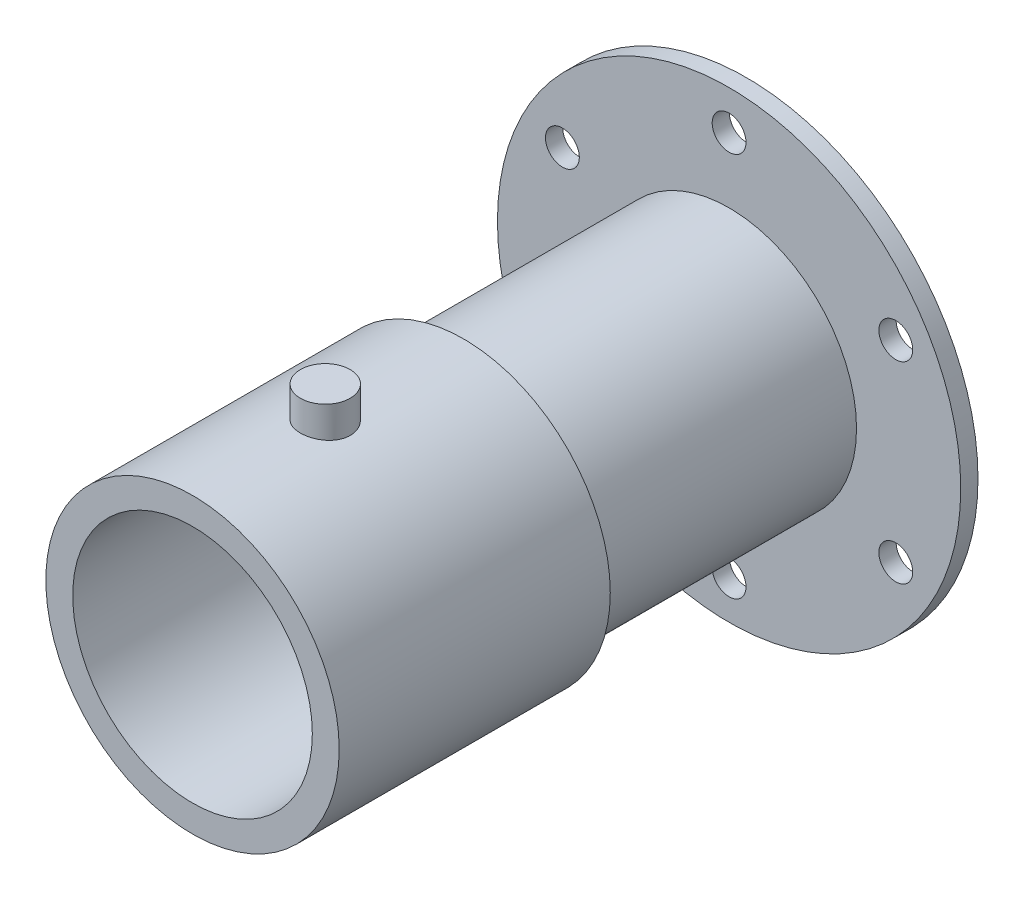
ISO-10303-21;
HEADER;
FILE_DESCRIPTION(('STEP AP214'),'2;1');
FILE_NAME('part.step','',(''),(''),'','','');
FILE_SCHEMA(('AUTOMOTIVE_DESIGN { 1 0 10303 214 1 1 1 1 }'));
ENDSEC;
DATA;
#1=APPLICATION_CONTEXT('core data for automotive mechanical design processes');
#2=APPLICATION_PROTOCOL_DEFINITION('international standard','automotive_design',2000,#1);
#3=PRODUCT_CONTEXT('',#1,'mechanical');
#4=PRODUCT('Part','Part','',(#3));
#5=PRODUCT_RELATED_PRODUCT_CATEGORY('part','',(#4));
#6=PRODUCT_DEFINITION_FORMATION('','',#4);
#7=PRODUCT_DEFINITION_CONTEXT('part definition',#1,'design');
#8=PRODUCT_DEFINITION('design','',#6,#7);
#9=PRODUCT_DEFINITION_SHAPE('','',#8);
#10=(LENGTH_UNIT() NAMED_UNIT(*) SI_UNIT(.MILLI.,.METRE.));
#11=(NAMED_UNIT(*) PLANE_ANGLE_UNIT() SI_UNIT($,.RADIAN.));
#12=(NAMED_UNIT(*) SI_UNIT($,.STERADIAN.) SOLID_ANGLE_UNIT());
#13=UNCERTAINTY_MEASURE_WITH_UNIT(LENGTH_MEASURE(1.E-05),#10,'distance_accuracy_value','');
#14=(GEOMETRIC_REPRESENTATION_CONTEXT(3) GLOBAL_UNCERTAINTY_ASSIGNED_CONTEXT((#13)) GLOBAL_UNIT_ASSIGNED_CONTEXT((#10,
#11,#12)) REPRESENTATION_CONTEXT('',''));
#15=CARTESIAN_POINT('',(0.,0.,0.));
#16=DIRECTION('',(0.,0.,1.));
#17=DIRECTION('',(1.,0.,0.));
#18=AXIS2_PLACEMENT_3D('',#15,#16,#17);
#19=CARTESIAN_POINT('',(0.,0.,3.302));
#20=DIRECTION('',(0.,0.,1.));
#21=DIRECTION('',(1.,0.,0.));
#22=AXIS2_PLACEMENT_3D('',#19,#20,#21);
#23=PLANE('',#22);
#24=CARTESIAN_POINT('',(-31.8957156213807,18.4150000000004,3.302));
#25=DIRECTION('',(0.,0.,1.));
#26=DIRECTION('',(0.50000000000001,0.866025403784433,0.));
#27=AXIS2_PLACEMENT_3D('',#24,#25,#26);
#28=CIRCLE('',#27,3.2385);
#29=CARTESIAN_POINT('',(-28.6572156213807,18.4150000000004,3.302));
#30=VERTEX_POINT('',#29);
#31=EDGE_CURVE('E89',#30,#30,#28,.T.);
#32=ORIENTED_EDGE('',*,*,#31,.F.);
#33=EDGE_LOOP('',(#32));
#34=FACE_BOUND('',#33,.T.);
#35=CARTESIAN_POINT('',(-31.895715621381,-18.4149999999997,3.302));
#36=DIRECTION('',(0.,0.,1.));
#37=DIRECTION('',(-0.499999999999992,0.866025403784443,0.));
#38=AXIS2_PLACEMENT_3D('',#35,#36,#37);
#39=CIRCLE('',#38,3.2385);
#40=CARTESIAN_POINT('',(-28.657215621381,-18.4149999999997,3.302));
#41=VERTEX_POINT('',#40);
#42=EDGE_CURVE('E83',#41,#41,#39,.T.);
#43=ORIENTED_EDGE('',*,*,#42,.F.);
#44=EDGE_LOOP('',(#43));
#45=FACE_BOUND('',#44,.T.);
#46=CARTESIAN_POINT('',(-2.57182664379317E-13,-36.83,3.302));
#47=DIRECTION('',(0.,0.,1.));
#48=DIRECTION('',(-1.,0.,0.));
#49=AXIS2_PLACEMENT_3D('',#46,#47,#48);
#50=CIRCLE('',#49,3.2385);
#51=CARTESIAN_POINT('',(3.23849999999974,-36.83,3.302));
#52=VERTEX_POINT('',#51);
#53=EDGE_CURVE('E77',#52,#52,#50,.T.);
#54=ORIENTED_EDGE('',*,*,#53,.F.);
#55=EDGE_LOOP('',(#54));
#56=FACE_BOUND('',#55,.T.);
#57=CARTESIAN_POINT('',(31.8957156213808,-18.4150000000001,3.302));
#58=DIRECTION('',(0.,0.,1.));
#59=DIRECTION('',(-0.500000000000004,-0.866025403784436,0.));
#60=AXIS2_PLACEMENT_3D('',#57,#58,#59);
#61=CIRCLE('',#60,3.2385);
#62=CARTESIAN_POINT('',(35.1342156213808,-18.4150000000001,3.302));
#63=VERTEX_POINT('',#62);
#64=EDGE_CURVE('E71',#63,#63,#61,.T.);
#65=ORIENTED_EDGE('',*,*,#64,.F.);
#66=EDGE_LOOP('',(#65));
#67=FACE_BOUND('',#66,.T.);
#68=CARTESIAN_POINT('',(31.8957156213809,18.4149999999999,3.302));
#69=DIRECTION('',(0.,0.,1.));
#70=DIRECTION('',(0.499999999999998,-0.86602540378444,0.));
#71=AXIS2_PLACEMENT_3D('',#68,#69,#70);
#72=CIRCLE('',#71,3.2385);
#73=CARTESIAN_POINT('',(35.1342156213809,18.4149999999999,3.302));
#74=VERTEX_POINT('',#73);
#75=EDGE_CURVE('E65',#74,#74,#72,.T.);
#76=ORIENTED_EDGE('',*,*,#75,.F.);
#77=EDGE_LOOP('',(#76));
#78=FACE_BOUND('',#77,.T.);
#79=CARTESIAN_POINT('',(0.,36.83,3.302));
#80=DIRECTION('',(0.,0.,1.));
#81=DIRECTION('',(1.,0.,0.));
#82=AXIS2_PLACEMENT_3D('',#79,#80,#81);
#83=CIRCLE('',#82,3.2385);
#84=CARTESIAN_POINT('',(3.2385,36.83,3.302));
#85=VERTEX_POINT('',#84);
#86=EDGE_CURVE('E59',#85,#85,#83,.T.);
#87=ORIENTED_EDGE('',*,*,#86,.F.);
#88=EDGE_LOOP('',(#87));
#89=FACE_BOUND('',#88,.T.);
#90=CARTESIAN_POINT('',(0.,0.,3.302));
#91=DIRECTION('',(0.,0.,1.));
#92=DIRECTION('',(1.,0.,0.));
#93=AXIS2_PLACEMENT_3D('',#90,#91,#92);
#94=CIRCLE('',#93,44.323);
#95=CARTESIAN_POINT('',(-44.323,0.,3.302));
#96=VERTEX_POINT('',#95);
#97=EDGE_CURVE('E10',#96,#96,#94,.T.);
#98=ORIENTED_EDGE('',*,*,#97,.T.);
#99=EDGE_LOOP('',(#98));
#100=FACE_BOUND('',#99,.T.);
#101=CARTESIAN_POINT('',(0.,0.,3.302));
#102=DIRECTION('',(0.,0.,1.));
#103=DIRECTION('',(1.,0.,0.));
#104=AXIS2_PLACEMENT_3D('',#101,#102,#103);
#105=CIRCLE('',#104,24.384);
#106=CARTESIAN_POINT('',(24.384,0.,3.302));
#107=VERTEX_POINT('',#106);
#108=EDGE_CURVE('E39',#107,#107,#105,.T.);
#109=ORIENTED_EDGE('',*,*,#108,.F.);
#110=EDGE_LOOP('',(#109));
#111=FACE_BOUND('',#110,.T.);
#112=ADVANCED_FACE('F24',(#34,#45,#56,#67,#78,#89,#100,#111),#23,.T.);
#113=CARTESIAN_POINT('',(0.,0.,3.302));
#114=DIRECTION('',(0.,0.,-1.));
#115=DIRECTION('',(-1.,0.,0.));
#116=AXIS2_PLACEMENT_3D('',#113,#114,#115);
#117=CYLINDRICAL_SURFACE('',#116,44.323);
#118=CARTESIAN_POINT('',(0.,0.,0.));
#119=DIRECTION('',(0.,0.,1.));
#120=DIRECTION('',(1.,0.,0.));
#121=AXIS2_PLACEMENT_3D('',#118,#119,#120);
#122=CIRCLE('',#121,44.323);
#123=CARTESIAN_POINT('',(-44.323,0.,0.));
#124=VERTEX_POINT('',#123);
#125=EDGE_CURVE('E31',#124,#124,#122,.T.);
#126=CARTESIAN_POINT('',(-44.323,0.,3.302));
#127=CARTESIAN_POINT('',(-44.323,0.,3.26760416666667));
#128=CARTESIAN_POINT('',(-44.323,0.,3.23320833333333));
#129=CARTESIAN_POINT('',(-44.323,0.,3.16441666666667));
#130=CARTESIAN_POINT('',(-44.323,0.,3.13002083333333));
#131=CARTESIAN_POINT('',(-44.323,0.,3.06122916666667));
#132=CARTESIAN_POINT('',(-44.323,0.,3.02683333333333));
#133=CARTESIAN_POINT('',(-44.323,0.,2.95804166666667));
#134=CARTESIAN_POINT('',(-44.323,0.,2.92364583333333));
#135=CARTESIAN_POINT('',(-44.323,0.,2.85485416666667));
#136=CARTESIAN_POINT('',(-44.323,0.,2.82045833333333));
#137=CARTESIAN_POINT('',(-44.323,0.,2.75166666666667));
#138=CARTESIAN_POINT('',(-44.323,0.,2.71727083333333));
#139=CARTESIAN_POINT('',(-44.323,0.,2.64847916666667));
#140=CARTESIAN_POINT('',(-44.323,0.,2.61408333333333));
#141=CARTESIAN_POINT('',(-44.323,0.,2.54529166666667));
#142=CARTESIAN_POINT('',(-44.323,0.,2.51089583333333));
#143=CARTESIAN_POINT('',(-44.323,0.,2.44210416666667));
#144=CARTESIAN_POINT('',(-44.323,0.,2.40770833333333));
#145=CARTESIAN_POINT('',(-44.323,0.,2.33891666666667));
#146=CARTESIAN_POINT('',(-44.323,0.,2.30452083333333));
#147=CARTESIAN_POINT('',(-44.323,0.,2.23572916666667));
#148=CARTESIAN_POINT('',(-44.323,0.,2.20133333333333));
#149=CARTESIAN_POINT('',(-44.323,0.,2.13254166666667));
#150=CARTESIAN_POINT('',(-44.323,0.,2.09814583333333));
#151=CARTESIAN_POINT('',(-44.323,0.,2.02935416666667));
#152=CARTESIAN_POINT('',(-44.323,0.,1.99495833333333));
#153=CARTESIAN_POINT('',(-44.323,0.,1.92616666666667));
#154=CARTESIAN_POINT('',(-44.323,0.,1.89177083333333));
#155=CARTESIAN_POINT('',(-44.323,0.,1.82297916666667));
#156=CARTESIAN_POINT('',(-44.323,0.,1.78858333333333));
#157=CARTESIAN_POINT('',(-44.323,0.,1.71979166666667));
#158=CARTESIAN_POINT('',(-44.323,0.,1.68539583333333));
#159=CARTESIAN_POINT('',(-44.323,0.,1.61660416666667));
#160=CARTESIAN_POINT('',(-44.323,0.,1.58220833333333));
#161=CARTESIAN_POINT('',(-44.323,0.,1.51341666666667));
#162=CARTESIAN_POINT('',(-44.323,0.,1.47902083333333));
#163=CARTESIAN_POINT('',(-44.323,0.,1.41022916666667));
#164=CARTESIAN_POINT('',(-44.323,0.,1.37583333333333));
#165=CARTESIAN_POINT('',(-44.323,0.,1.30704166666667));
#166=CARTESIAN_POINT('',(-44.323,0.,1.27264583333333));
#167=CARTESIAN_POINT('',(-44.323,0.,1.20385416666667));
#168=CARTESIAN_POINT('',(-44.323,0.,1.16945833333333));
#169=CARTESIAN_POINT('',(-44.323,0.,1.10066666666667));
#170=CARTESIAN_POINT('',(-44.323,0.,1.06627083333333));
#171=CARTESIAN_POINT('',(-44.323,0.,0.997479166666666));
#172=CARTESIAN_POINT('',(-44.323,0.,0.963083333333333));
#173=CARTESIAN_POINT('',(-44.323,0.,0.894291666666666));
#174=CARTESIAN_POINT('',(-44.323,0.,0.859895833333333));
#175=CARTESIAN_POINT('',(-44.323,0.,0.791104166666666));
#176=CARTESIAN_POINT('',(-44.323,0.,0.756708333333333));
#177=CARTESIAN_POINT('',(-44.323,0.,0.687916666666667));
#178=CARTESIAN_POINT('',(-44.323,0.,0.653520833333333));
#179=CARTESIAN_POINT('',(-44.323,0.,0.584729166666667));
#180=CARTESIAN_POINT('',(-44.323,0.,0.550333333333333));
#181=CARTESIAN_POINT('',(-44.323,0.,0.481541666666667));
#182=CARTESIAN_POINT('',(-44.323,0.,0.447145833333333));
#183=CARTESIAN_POINT('',(-44.323,0.,0.378354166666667));
#184=CARTESIAN_POINT('',(-44.323,0.,0.343958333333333));
#185=CARTESIAN_POINT('',(-44.323,0.,0.275166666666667));
#186=CARTESIAN_POINT('',(-44.323,0.,0.240770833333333));
#187=CARTESIAN_POINT('',(-44.323,0.,0.171979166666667));
#188=CARTESIAN_POINT('',(-44.323,0.,0.137583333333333));
#189=CARTESIAN_POINT('',(-44.323,0.,0.0687916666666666));
#190=CARTESIAN_POINT('',(-44.323,0.,0.0343958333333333));
#191=CARTESIAN_POINT('',(-44.323,0.,0.));
#192=B_SPLINE_CURVE_WITH_KNOTS('',3,(#126,#127,#128,#129,#130,#131,#132,#133,#134,#135,#136,
#137,#138,#139,#140,#141,#142,#143,#144,#145,#146,#147,#148,#149,#150,#151,#152,#153,#154,#155,
#156,#157,#158,#159,#160,#161,#162,#163,#164,#165,#166,#167,#168,#169,#170,#171,#172,#173,#174,
#175,#176,#177,#178,#179,#180,#181,#182,#183,#184,#185,#186,#187,#188,#189,#190,#191),
.UNSPECIFIED.,.F.,.F.,(4,2,2,2,2,2,2,2,2,2,2,2,2,2,2,2,2,2,2,2,2,2,2,2,2,2,2,2,2,2,2,2,4),(0.,
0.1031875,0.206375,0.3095625,0.41275,0.5159375,0.619125,0.7223125,0.8255,0.9286875,1.031875,
1.1350625,1.23825,1.3414375,1.444625,1.5478125,1.651,1.7541875,1.857375,1.9605625,2.06375,
2.1669375,2.270125,2.3733125,2.4765,2.5796875,2.682875,2.7860625,2.88925,2.9924375,3.095625,
3.1988125,3.302),.UNSPECIFIED.);
#193=EDGE_CURVE('BSEAM26',#96,#124,#192,.T.);
#194=ORIENTED_EDGE('',*,*,#97,.F.);
#195=ORIENTED_EDGE('',*,*,#125,.T.);
#196=ORIENTED_EDGE('',*,*,#193,.T.);
#197=ORIENTED_EDGE('',*,*,#193,.F.);
#198=EDGE_LOOP('',(#194,#196,#195,#197));
#199=FACE_BOUND('',#198,.T.);
#200=ADVANCED_FACE('F26',(#199),#117,.T.);
#201=CARTESIAN_POINT('',(0.,0.,0.));
#202=DIRECTION('',(0.,0.,1.));
#203=DIRECTION('',(1.,0.,0.));
#204=AXIS2_PLACEMENT_3D('',#201,#202,#203);
#205=PLANE('',#204);
#206=CARTESIAN_POINT('',(-31.8957156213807,18.4150000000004,0.));
#207=DIRECTION('',(0.,0.,1.));
#208=DIRECTION('',(0.50000000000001,0.866025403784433,0.));
#209=AXIS2_PLACEMENT_3D('',#206,#207,#208);
#210=CIRCLE('',#209,3.2385);
#211=CARTESIAN_POINT('',(-28.6572156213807,18.4150000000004,0.));
#212=VERTEX_POINT('',#211);
#213=EDGE_CURVE('E86',#212,#212,#210,.T.);
#214=ORIENTED_EDGE('',*,*,#213,.T.);
#215=EDGE_LOOP('',(#214));
#216=FACE_BOUND('',#215,.T.);
#217=CARTESIAN_POINT('',(-31.895715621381,-18.4149999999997,0.));
#218=DIRECTION('',(0.,0.,1.));
#219=DIRECTION('',(-0.499999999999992,0.866025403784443,0.));
#220=AXIS2_PLACEMENT_3D('',#217,#218,#219);
#221=CIRCLE('',#220,3.2385);
#222=CARTESIAN_POINT('',(-28.657215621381,-18.4149999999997,0.));
#223=VERTEX_POINT('',#222);
#224=EDGE_CURVE('E80',#223,#223,#221,.T.);
#225=ORIENTED_EDGE('',*,*,#224,.T.);
#226=EDGE_LOOP('',(#225));
#227=FACE_BOUND('',#226,.T.);
#228=CARTESIAN_POINT('',(-2.57182664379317E-13,-36.83,0.));
#229=DIRECTION('',(0.,0.,1.));
#230=DIRECTION('',(-1.,0.,0.));
#231=AXIS2_PLACEMENT_3D('',#228,#229,#230);
#232=CIRCLE('',#231,3.2385);
#233=CARTESIAN_POINT('',(3.23849999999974,-36.83,0.));
#234=VERTEX_POINT('',#233);
#235=EDGE_CURVE('E74',#234,#234,#232,.T.);
#236=ORIENTED_EDGE('',*,*,#235,.T.);
#237=EDGE_LOOP('',(#236));
#238=FACE_BOUND('',#237,.T.);
#239=CARTESIAN_POINT('',(31.8957156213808,-18.4150000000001,0.));
#240=DIRECTION('',(0.,0.,1.));
#241=DIRECTION('',(-0.500000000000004,-0.866025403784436,0.));
#242=AXIS2_PLACEMENT_3D('',#239,#240,#241);
#243=CIRCLE('',#242,3.2385);
#244=CARTESIAN_POINT('',(35.1342156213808,-18.4150000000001,0.));
#245=VERTEX_POINT('',#244);
#246=EDGE_CURVE('E68',#245,#245,#243,.T.);
#247=ORIENTED_EDGE('',*,*,#246,.T.);
#248=EDGE_LOOP('',(#247));
#249=FACE_BOUND('',#248,.T.);
#250=CARTESIAN_POINT('',(31.8957156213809,18.4149999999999,0.));
#251=DIRECTION('',(0.,0.,1.));
#252=DIRECTION('',(0.499999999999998,-0.86602540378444,0.));
#253=AXIS2_PLACEMENT_3D('',#250,#251,#252);
#254=CIRCLE('',#253,3.2385);
#255=CARTESIAN_POINT('',(35.1342156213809,18.4149999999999,0.));
#256=VERTEX_POINT('',#255);
#257=EDGE_CURVE('E62',#256,#256,#254,.T.);
#258=ORIENTED_EDGE('',*,*,#257,.T.);
#259=EDGE_LOOP('',(#258));
#260=FACE_BOUND('',#259,.T.);
#261=CARTESIAN_POINT('',(0.,36.83,0.));
#262=DIRECTION('',(0.,0.,1.));
#263=DIRECTION('',(1.,0.,0.));
#264=AXIS2_PLACEMENT_3D('',#261,#262,#263);
#265=CIRCLE('',#264,3.2385);
#266=CARTESIAN_POINT('',(3.2385,36.83,0.));
#267=VERTEX_POINT('',#266);
#268=EDGE_CURVE('E56',#267,#267,#265,.T.);
#269=ORIENTED_EDGE('',*,*,#268,.T.);
#270=EDGE_LOOP('',(#269));
#271=FACE_BOUND('',#270,.T.);
#272=ORIENTED_EDGE('',*,*,#125,.F.);
#273=EDGE_LOOP('',(#272));
#274=FACE_BOUND('',#273,.T.);
#275=ADVANCED_FACE('F121',(#216,#227,#238,#249,#260,#271,#274),#205,.F.);
#276=CARTESIAN_POINT('',(0.,0.,54.102));
#277=DIRECTION('',(0.,0.,-1.));
#278=DIRECTION('',(-1.,0.,0.));
#279=AXIS2_PLACEMENT_3D('',#276,#277,#278);
#280=CYLINDRICAL_SURFACE('',#279,24.384);
#281=CARTESIAN_POINT('',(0.,0.,54.102));
#282=DIRECTION('',(0.,0.,1.));
#283=DIRECTION('',(1.,0.,0.));
#284=AXIS2_PLACEMENT_3D('',#281,#282,#283);
#285=CIRCLE('',#284,24.384);
#286=CARTESIAN_POINT('',(24.384,0.,54.102));
#287=VERTEX_POINT('',#286);
#288=EDGE_CURVE('E35',#287,#287,#285,.T.);
#289=ORIENTED_EDGE('',*,*,#288,.F.);
#290=EDGE_LOOP('',(#289));
#291=FACE_BOUND('',#290,.T.);
#292=ORIENTED_EDGE('',*,*,#108,.T.);
#293=EDGE_LOOP('',(#292));
#294=FACE_BOUND('',#293,.T.);
#295=ADVANCED_FACE('F127',(#291,#294),#280,.T.);
#296=CARTESIAN_POINT('',(0.,0.,54.102));
#297=DIRECTION('',(0.,0.,1.));
#298=DIRECTION('',(1.,0.,0.));
#299=AXIS2_PLACEMENT_3D('',#296,#297,#298);
#300=PLANE('',#299);
#301=CARTESIAN_POINT('',(0.,0.,54.102));
#302=DIRECTION('',(0.,0.,1.));
#303=DIRECTION('',(1.,0.,0.));
#304=AXIS2_PLACEMENT_3D('',#301,#302,#303);
#305=CIRCLE('',#304,28.067);
#306=CARTESIAN_POINT('',(28.067,0.,54.102));
#307=VERTEX_POINT('',#306);
#308=EDGE_CURVE('E47',#307,#307,#305,.T.);
#309=ORIENTED_EDGE('',*,*,#308,.F.);
#310=EDGE_LOOP('',(#309));
#311=FACE_BOUND('',#310,.T.);
#312=ORIENTED_EDGE('',*,*,#288,.T.);
#313=EDGE_LOOP('',(#312));
#314=FACE_BOUND('',#313,.T.);
#315=ADVANCED_FACE('F131',(#311,#314),#300,.F.);
#316=CARTESIAN_POINT('',(0.,0.,105.9688));
#317=DIRECTION('',(0.,0.,-1.));
#318=DIRECTION('',(-1.,0.,0.));
#319=AXIS2_PLACEMENT_3D('',#316,#317,#318);
#320=CYLINDRICAL_SURFACE('',#319,28.067);
#321=CARTESIAN_POINT('',(0.,28.067,85.3313));
#322=CARTESIAN_POINT('',(0.265468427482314,28.0669954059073,85.3312894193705));
#323=CARTESIAN_POINT('',(0.531079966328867,28.0631944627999,85.3090286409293));
#324=CARTESIAN_POINT('',(1.05484861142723,28.0483978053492,85.2206135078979));
#325=CARTESIAN_POINT('',(1.31299871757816,28.0373955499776,85.1544192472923));
#326=CARTESIAN_POINT('',(1.81419127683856,28.0094298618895,84.980197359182));
#327=CARTESIAN_POINT('',(2.05724607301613,27.9924713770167,84.8722044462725));
#328=CARTESIAN_POINT('',(2.52175623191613,27.9544560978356,84.6175427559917));
#329=CARTESIAN_POINT('',(2.74321396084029,27.9333997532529,84.4708782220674));
#330=CARTESIAN_POINT('',(3.16046456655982,27.8892886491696,84.1414933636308));
#331=CARTESIAN_POINT('',(3.35601276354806,27.866217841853,83.9584652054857));
#332=CARTESIAN_POINT('',(3.7137794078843,27.8208003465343,83.5622111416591));
#333=CARTESIAN_POINT('',(3.87599571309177,27.7984537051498,83.3489832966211));
#334=CARTESIAN_POINT('',(4.16347957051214,27.7568592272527,82.8966951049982));
#335=CARTESIAN_POINT('',(4.28850420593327,27.7376321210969,82.6574782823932));
#336=CARTESIAN_POINT('',(4.49650209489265,27.7046768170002,82.1610576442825));
#337=CARTESIAN_POINT('',(4.57947829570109,27.6909482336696,81.9038550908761));
#338=CARTESIAN_POINT('',(4.70025101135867,27.6707043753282,81.3813611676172));
#339=CARTESIAN_POINT('',(4.73847055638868,27.664121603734,81.1161702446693));
#340=CARTESIAN_POINT('',(4.76995685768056,27.6587106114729,80.5830640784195));
#341=CARTESIAN_POINT('',(4.76322691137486,27.6598818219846,80.3151490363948));
#342=CARTESIAN_POINT('',(4.70534962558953,27.6697848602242,79.7872257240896));
#343=CARTESIAN_POINT('',(4.65467829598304,27.6784356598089,79.5271635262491));
#344=CARTESIAN_POINT('',(4.51110400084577,27.7021962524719,79.0192861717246));
#345=CARTESIAN_POINT('',(4.4181995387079,27.7173062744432,78.771471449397));
#346=CARTESIAN_POINT('',(4.19231595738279,27.7523699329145,78.2937030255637));
#347=CARTESIAN_POINT('',(4.05913992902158,27.7723472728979,78.0638442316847));
#348=CARTESIAN_POINT('',(3.75663332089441,27.8148782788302,77.6295557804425));
#349=CARTESIAN_POINT('',(3.58729971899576,27.8374321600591,77.4251282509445));
#350=CARTESIAN_POINT('',(3.21469491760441,27.8829306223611,77.0447505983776));
#351=CARTESIAN_POINT('',(3.01101547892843,27.9058764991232,76.8692002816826));
#352=CARTESIAN_POINT('',(2.57687937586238,27.9493057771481,76.5547069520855));
#353=CARTESIAN_POINT('',(2.34642252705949,27.9697891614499,76.4157641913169));
#354=CARTESIAN_POINT('',(1.86489184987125,28.0060162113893,76.1783905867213));
#355=CARTESIAN_POINT('',(1.61379984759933,28.0217556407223,76.0799959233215));
#356=CARTESIAN_POINT('',(1.09832729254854,28.0466875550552,75.9268871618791));
#357=CARTESIAN_POINT('',(0.833947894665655,28.0558806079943,75.8721692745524));
#358=CARTESIAN_POINT('',(0.302850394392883,28.0666073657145,75.8085112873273));
#359=CARTESIAN_POINT('',(0.0361998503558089,28.0682328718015,75.7990224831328));
#360=CARTESIAN_POINT('',(-0.494880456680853,28.0638931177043,75.8246279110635));
#361=CARTESIAN_POINT('',(-0.759310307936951,28.0579281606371,75.8597203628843));
#362=CARTESIAN_POINT('',(-1.27674190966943,28.0391345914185,75.9730357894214));
#363=CARTESIAN_POINT('',(-1.52980504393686,28.0263493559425,76.0509862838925));
#364=CARTESIAN_POINT('',(-2.019271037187,27.9953430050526,76.2475139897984));
#365=CARTESIAN_POINT('',(-2.25567293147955,27.9771215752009,76.3660935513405));
#366=CARTESIAN_POINT('',(-2.7074835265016,27.9370361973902,76.6417642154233));
#367=CARTESIAN_POINT('',(-2.9226808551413,27.9151405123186,76.7991970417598));
#368=CARTESIAN_POINT('',(-3.3237981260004,27.8702290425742,77.1476362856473));
#369=CARTESIAN_POINT('',(-3.50971585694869,27.847213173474,77.3386452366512));
#370=CARTESIAN_POINT('',(-3.84903742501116,27.8023574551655,77.751278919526));
#371=CARTESIAN_POINT('',(-4.00207000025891,27.7805329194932,77.9732108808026));
#372=CARTESIAN_POINT('',(-4.26868195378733,27.7408198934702,78.4399540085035));
#373=CARTESIAN_POINT('',(-4.38226261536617,27.7229312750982,78.6847644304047));
#374=CARTESIAN_POINT('',(-4.56619528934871,27.6932311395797,79.1892903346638));
#375=CARTESIAN_POINT('',(-4.63673007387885,27.6813939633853,79.4489376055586));
#376=CARTESIAN_POINT('',(-4.73314247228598,27.6650733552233,79.9766129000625));
#377=CARTESIAN_POINT('',(-4.75902412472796,27.6605892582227,80.244640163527));
#378=CARTESIAN_POINT('',(-4.7652798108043,27.6595118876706,80.7777583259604));
#379=CARTESIAN_POINT('',(-4.74623838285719,27.6628172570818,81.0428423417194));
#380=CARTESIAN_POINT('',(-4.66445456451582,27.6767238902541,81.5659759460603));
#381=CARTESIAN_POINT('',(-4.6017123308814,27.6873251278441,81.8240255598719));
#382=CARTESIAN_POINT('',(-4.4345350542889,27.7145899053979,82.3255270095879));
#383=CARTESIAN_POINT('',(-4.33015213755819,27.7312458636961,82.5689966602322));
#384=CARTESIAN_POINT('',(-4.08271707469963,27.7687504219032,83.035062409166));
#385=CARTESIAN_POINT('',(-3.93966289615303,27.7895992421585,83.2576574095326));
#386=CARTESIAN_POINT('',(-3.61686733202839,27.8334608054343,83.6786050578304));
#387=CARTESIAN_POINT('',(-3.43669652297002,27.8564970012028,83.8766260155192));
#388=CARTESIAN_POINT('',(-3.04568638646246,27.9019522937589,84.2398232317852));
#389=CARTESIAN_POINT('',(-2.83483999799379,27.9243712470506,84.4049919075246));
#390=CARTESIAN_POINT('',(-2.386660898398,27.9662530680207,84.6988843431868));
#391=CARTESIAN_POINT('',(-2.14914876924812,27.9856935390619,84.8273377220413));
#392=CARTESIAN_POINT('',(-1.65568130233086,28.0192100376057,85.0423235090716));
#393=CARTESIAN_POINT('',(-1.39974447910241,28.0332913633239,85.1288973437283));
#394=CARTESIAN_POINT('',(-0.952370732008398,28.051457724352,85.2390413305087));
#395=CARTESIAN_POINT('',(-0.763628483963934,28.0572546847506,85.2735824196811));
#396=CARTESIAN_POINT('',(-0.383282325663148,28.065027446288,85.3197153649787));
#397=CARTESIAN_POINT('',(-0.191678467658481,28.0670033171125,85.3313076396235));
#398=CARTESIAN_POINT('',(0.,28.067,85.3313));
#399=B_SPLINE_CURVE_WITH_KNOTS('',3,(#321,#322,#323,#324,#325,#326,#327,#328,#329,#330,#331,
#332,#333,#334,#335,#336,#337,#338,#339,#340,#341,#342,#343,#344,#345,#346,#347,#348,#349,#350,
#351,#352,#353,#354,#355,#356,#357,#358,#359,#360,#361,#362,#363,#364,#365,#366,#367,#368,#369,
#370,#371,#372,#373,#374,#375,#376,#377,#378,#379,#380,#381,#382,#383,#384,#385,#386,#387,#388,
#389,#390,#391,#392,#393,#394,#395,#396,#397,#398),.UNSPECIFIED.,.T.,.F.,(4,2,2,2,2,2,2,2,2,2,2,
2,2,2,2,2,2,2,2,2,2,2,2,2,2,2,2,2,2,2,2,2,2,2,2,2,2,2,4),(0.,0.795704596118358,1.59213294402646,
2.38790125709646,3.18358228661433,3.98631049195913,4.78909027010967,5.59700373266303,
6.40486055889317,7.20501844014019,8.00511762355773,8.79665622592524,9.58822288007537,
10.3837242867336,11.1792922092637,11.9850859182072,12.790885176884,13.5974018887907,
14.4038486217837,15.2004864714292,15.9970925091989,16.7886915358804,17.5803363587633,
18.3792088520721,19.1781416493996,19.9856684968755,20.7931690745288,21.5972167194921,
22.4011916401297,23.194763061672,23.9883316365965,24.7809099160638,25.5735298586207,
26.3758945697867,27.1784442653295,27.9867602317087,28.794274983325,29.3688149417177,
29.9433444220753),.UNSPECIFIED.);
#400=CARTESIAN_POINT('',(0.,28.067,85.3313));
#401=VERTEX_POINT('',#400);
#402=EDGE_CURVE('E92',#401,#401,#399,.T.);
#403=ORIENTED_EDGE('',*,*,#402,.F.);
#404=EDGE_LOOP('',(#403));
#405=FACE_BOUND('',#404,.T.);
#406=CARTESIAN_POINT('',(0.,0.,105.9688));
#407=DIRECTION('',(0.,0.,1.));
#408=DIRECTION('',(1.,0.,0.));
#409=AXIS2_PLACEMENT_3D('',#406,#407,#408);
#410=CIRCLE('',#409,28.067);
#411=CARTESIAN_POINT('',(28.067,0.,105.9688));
#412=VERTEX_POINT('',#411);
#413=EDGE_CURVE('E44',#412,#412,#410,.T.);
#414=ORIENTED_EDGE('',*,*,#413,.F.);
#415=EDGE_LOOP('',(#414));
#416=FACE_BOUND('',#415,.T.);
#417=ORIENTED_EDGE('',*,*,#308,.T.);
#418=EDGE_LOOP('',(#417));
#419=FACE_BOUND('',#418,.T.);
#420=ADVANCED_FACE('F133',(#405,#416,#419),#320,.T.);
#421=CARTESIAN_POINT('',(0.,0.,105.9688));
#422=DIRECTION('',(0.,0.,1.));
#423=DIRECTION('',(1.,0.,0.));
#424=AXIS2_PLACEMENT_3D('',#421,#422,#423);
#425=PLANE('',#424);
#426=CARTESIAN_POINT('',(0.,0.,105.9688));
#427=DIRECTION('',(0.,0.,1.));
#428=DIRECTION('',(1.,0.,0.));
#429=AXIS2_PLACEMENT_3D('',#426,#427,#428);
#430=CIRCLE('',#429,22.9235);
#431=CARTESIAN_POINT('',(22.9235,0.,105.9688));
#432=VERTEX_POINT('',#431);
#433=EDGE_CURVE('E53',#432,#432,#430,.T.);
#434=ORIENTED_EDGE('',*,*,#433,.F.);
#435=EDGE_LOOP('',(#434));
#436=FACE_BOUND('',#435,.T.);
#437=ORIENTED_EDGE('',*,*,#413,.T.);
#438=EDGE_LOOP('',(#437));
#439=FACE_BOUND('',#438,.T.);
#440=ADVANCED_FACE('F136',(#436,#439),#425,.T.);
#441=CARTESIAN_POINT('',(0.,0.,61.5188));
#442=DIRECTION('',(0.,0.,1.));
#443=DIRECTION('',(1.,0.,0.));
#444=AXIS2_PLACEMENT_3D('',#441,#442,#443);
#445=CYLINDRICAL_SURFACE('',#444,22.9235);
#446=CARTESIAN_POINT('',(0.,0.,61.5188));
#447=DIRECTION('',(0.,0.,1.));
#448=DIRECTION('',(1.,0.,0.));
#449=AXIS2_PLACEMENT_3D('',#446,#447,#448);
#450=CIRCLE('',#449,22.9235);
#451=CARTESIAN_POINT('',(22.9235,0.,61.5188));
#452=VERTEX_POINT('',#451);
#453=EDGE_CURVE('E50',#452,#452,#450,.T.);
#454=ORIENTED_EDGE('',*,*,#453,.F.);
#455=EDGE_LOOP('',(#454));
#456=FACE_BOUND('',#455,.T.);
#457=ORIENTED_EDGE('',*,*,#433,.T.);
#458=EDGE_LOOP('',(#457));
#459=FACE_BOUND('',#458,.T.);
#460=ADVANCED_FACE('F140',(#456,#459),#445,.F.);
#461=CARTESIAN_POINT('',(0.,0.,61.5188));
#462=DIRECTION('',(0.,0.,1.));
#463=DIRECTION('',(1.,0.,0.));
#464=AXIS2_PLACEMENT_3D('',#461,#462,#463);
#465=PLANE('',#464);
#466=ORIENTED_EDGE('',*,*,#453,.T.);
#467=EDGE_LOOP('',(#466));
#468=FACE_BOUND('',#467,.T.);
#469=ADVANCED_FACE('F147',(#468),#465,.T.);
#470=CARTESIAN_POINT('',(0.,36.83,0.));
#471=DIRECTION('',(0.,0.,1.));
#472=DIRECTION('',(1.,0.,0.));
#473=AXIS2_PLACEMENT_3D('',#470,#471,#472);
#474=CYLINDRICAL_SURFACE('',#473,3.2385);
#475=CARTESIAN_POINT('',(3.2385,36.83,0.));
#476=CARTESIAN_POINT('',(3.2385,36.83,0.0343958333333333));
#477=CARTESIAN_POINT('',(3.2385,36.83,0.0687916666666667));
#478=CARTESIAN_POINT('',(3.2385,36.83,0.137583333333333));
#479=CARTESIAN_POINT('',(3.2385,36.83,0.171979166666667));
#480=CARTESIAN_POINT('',(3.2385,36.83,0.240770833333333));
#481=CARTESIAN_POINT('',(3.2385,36.83,0.275166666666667));
#482=CARTESIAN_POINT('',(3.2385,36.83,0.343958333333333));
#483=CARTESIAN_POINT('',(3.2385,36.83,0.378354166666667));
#484=CARTESIAN_POINT('',(3.2385,36.83,0.447145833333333));
#485=CARTESIAN_POINT('',(3.2385,36.83,0.481541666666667));
#486=CARTESIAN_POINT('',(3.2385,36.83,0.550333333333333));
#487=CARTESIAN_POINT('',(3.2385,36.83,0.584729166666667));
#488=CARTESIAN_POINT('',(3.2385,36.83,0.653520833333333));
#489=CARTESIAN_POINT('',(3.2385,36.83,0.687916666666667));
#490=CARTESIAN_POINT('',(3.2385,36.83,0.756708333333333));
#491=CARTESIAN_POINT('',(3.2385,36.83,0.791104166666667));
#492=CARTESIAN_POINT('',(3.2385,36.83,0.859895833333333));
#493=CARTESIAN_POINT('',(3.2385,36.83,0.894291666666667));
#494=CARTESIAN_POINT('',(3.2385,36.83,0.963083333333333));
#495=CARTESIAN_POINT('',(3.2385,36.83,0.997479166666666));
#496=CARTESIAN_POINT('',(3.2385,36.83,1.06627083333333));
#497=CARTESIAN_POINT('',(3.2385,36.83,1.10066666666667));
#498=CARTESIAN_POINT('',(3.2385,36.83,1.16945833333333));
#499=CARTESIAN_POINT('',(3.2385,36.83,1.20385416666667));
#500=CARTESIAN_POINT('',(3.2385,36.83,1.27264583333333));
#501=CARTESIAN_POINT('',(3.2385,36.83,1.30704166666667));
#502=CARTESIAN_POINT('',(3.2385,36.83,1.37583333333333));
#503=CARTESIAN_POINT('',(3.2385,36.83,1.41022916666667));
#504=CARTESIAN_POINT('',(3.2385,36.83,1.47902083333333));
#505=CARTESIAN_POINT('',(3.2385,36.83,1.51341666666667));
#506=CARTESIAN_POINT('',(3.2385,36.83,1.58220833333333));
#507=CARTESIAN_POINT('',(3.2385,36.83,1.61660416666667));
#508=CARTESIAN_POINT('',(3.2385,36.83,1.68539583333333));
#509=CARTESIAN_POINT('',(3.2385,36.83,1.71979166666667));
#510=CARTESIAN_POINT('',(3.2385,36.83,1.78858333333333));
#511=CARTESIAN_POINT('',(3.2385,36.83,1.82297916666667));
#512=CARTESIAN_POINT('',(3.2385,36.83,1.89177083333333));
#513=CARTESIAN_POINT('',(3.2385,36.83,1.92616666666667));
#514=CARTESIAN_POINT('',(3.2385,36.83,1.99495833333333));
#515=CARTESIAN_POINT('',(3.2385,36.83,2.02935416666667));
#516=CARTESIAN_POINT('',(3.2385,36.83,2.09814583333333));
#517=CARTESIAN_POINT('',(3.2385,36.83,2.13254166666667));
#518=CARTESIAN_POINT('',(3.2385,36.83,2.20133333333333));
#519=CARTESIAN_POINT('',(3.2385,36.83,2.23572916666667));
#520=CARTESIAN_POINT('',(3.2385,36.83,2.30452083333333));
#521=CARTESIAN_POINT('',(3.2385,36.83,2.33891666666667));
#522=CARTESIAN_POINT('',(3.2385,36.83,2.40770833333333));
#523=CARTESIAN_POINT('',(3.2385,36.83,2.44210416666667));
#524=CARTESIAN_POINT('',(3.2385,36.83,2.51089583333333));
#525=CARTESIAN_POINT('',(3.2385,36.83,2.54529166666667));
#526=CARTESIAN_POINT('',(3.2385,36.83,2.61408333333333));
#527=CARTESIAN_POINT('',(3.2385,36.83,2.64847916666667));
#528=CARTESIAN_POINT('',(3.2385,36.83,2.71727083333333));
#529=CARTESIAN_POINT('',(3.2385,36.83,2.75166666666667));
#530=CARTESIAN_POINT('',(3.2385,36.83,2.82045833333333));
#531=CARTESIAN_POINT('',(3.2385,36.83,2.85485416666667));
#532=CARTESIAN_POINT('',(3.2385,36.83,2.92364583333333));
#533=CARTESIAN_POINT('',(3.2385,36.83,2.95804166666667));
#534=CARTESIAN_POINT('',(3.2385,36.83,3.02683333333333));
#535=CARTESIAN_POINT('',(3.2385,36.83,3.06122916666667));
#536=CARTESIAN_POINT('',(3.2385,36.83,3.13002083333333));
#537=CARTESIAN_POINT('',(3.2385,36.83,3.16441666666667));
#538=CARTESIAN_POINT('',(3.2385,36.83,3.23320833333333));
#539=CARTESIAN_POINT('',(3.2385,36.83,3.26760416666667));
#540=CARTESIAN_POINT('',(3.2385,36.83,3.302));
#541=B_SPLINE_CURVE_WITH_KNOTS('',3,(#475,#476,#477,#478,#479,#480,#481,#482,#483,#484,#485,
#486,#487,#488,#489,#490,#491,#492,#493,#494,#495,#496,#497,#498,#499,#500,#501,#502,#503,#504,
#505,#506,#507,#508,#509,#510,#511,#512,#513,#514,#515,#516,#517,#518,#519,#520,#521,#522,#523,
#524,#525,#526,#527,#528,#529,#530,#531,#532,#533,#534,#535,#536,#537,#538,#539,#540),
.UNSPECIFIED.,.F.,.F.,(4,2,2,2,2,2,2,2,2,2,2,2,2,2,2,2,2,2,2,2,2,2,2,2,2,2,2,2,2,2,2,2,4),(0.,
0.1031875,0.206375,0.3095625,0.41275,0.5159375,0.619125,0.7223125,0.8255,0.9286875,1.031875,
1.1350625,1.23825,1.3414375,1.444625,1.5478125,1.651,1.7541875,1.857375,1.9605625,2.06375,
2.1669375,2.270125,2.3733125,2.4765,2.5796875,2.682875,2.7860625,2.88925,2.9924375,3.095625,
3.1988125,3.302),.UNSPECIFIED.);
#542=EDGE_CURVE('BSEAM151',#267,#85,#541,.T.);
#543=ORIENTED_EDGE('',*,*,#268,.F.);
#544=ORIENTED_EDGE('',*,*,#86,.T.);
#545=ORIENTED_EDGE('',*,*,#542,.T.);
#546=ORIENTED_EDGE('',*,*,#542,.F.);
#547=EDGE_LOOP('',(#543,#545,#544,#546));
#548=FACE_BOUND('',#547,.T.);
#549=ADVANCED_FACE('F151',(#548),#474,.F.);
#550=CARTESIAN_POINT('',(31.8957156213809,18.4149999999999,0.));
#551=DIRECTION('',(0.,0.,1.));
#552=DIRECTION('',(1.,0.,0.));
#553=AXIS2_PLACEMENT_3D('',#550,#551,#552);
#554=CYLINDRICAL_SURFACE('',#553,3.2385);
#555=CARTESIAN_POINT('',(35.1342156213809,18.4149999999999,0.));
#556=CARTESIAN_POINT('',(35.1342156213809,18.4149999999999,0.0343958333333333));
#557=CARTESIAN_POINT('',(35.1342156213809,18.4149999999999,0.0687916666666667));
#558=CARTESIAN_POINT('',(35.1342156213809,18.4149999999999,0.137583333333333));
#559=CARTESIAN_POINT('',(35.1342156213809,18.4149999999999,0.171979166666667));
#560=CARTESIAN_POINT('',(35.1342156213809,18.4149999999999,0.240770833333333));
#561=CARTESIAN_POINT('',(35.1342156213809,18.4149999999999,0.275166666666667));
#562=CARTESIAN_POINT('',(35.1342156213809,18.4149999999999,0.343958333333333));
#563=CARTESIAN_POINT('',(35.1342156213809,18.4149999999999,0.378354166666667));
#564=CARTESIAN_POINT('',(35.1342156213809,18.4149999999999,0.447145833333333));
#565=CARTESIAN_POINT('',(35.1342156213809,18.4149999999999,0.481541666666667));
#566=CARTESIAN_POINT('',(35.1342156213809,18.4149999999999,0.550333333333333));
#567=CARTESIAN_POINT('',(35.1342156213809,18.4149999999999,0.584729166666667));
#568=CARTESIAN_POINT('',(35.1342156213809,18.4149999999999,0.653520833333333));
#569=CARTESIAN_POINT('',(35.1342156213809,18.4149999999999,0.687916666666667));
#570=CARTESIAN_POINT('',(35.1342156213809,18.4149999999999,0.756708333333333));
#571=CARTESIAN_POINT('',(35.1342156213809,18.4149999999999,0.791104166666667));
#572=CARTESIAN_POINT('',(35.1342156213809,18.4149999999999,0.859895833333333));
#573=CARTESIAN_POINT('',(35.1342156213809,18.4149999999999,0.894291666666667));
#574=CARTESIAN_POINT('',(35.1342156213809,18.4149999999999,0.963083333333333));
#575=CARTESIAN_POINT('',(35.1342156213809,18.4149999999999,0.997479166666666));
#576=CARTESIAN_POINT('',(35.1342156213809,18.4149999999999,1.06627083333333));
#577=CARTESIAN_POINT('',(35.1342156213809,18.4149999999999,1.10066666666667));
#578=CARTESIAN_POINT('',(35.1342156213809,18.4149999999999,1.16945833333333));
#579=CARTESIAN_POINT('',(35.1342156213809,18.4149999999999,1.20385416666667));
#580=CARTESIAN_POINT('',(35.1342156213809,18.4149999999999,1.27264583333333));
#581=CARTESIAN_POINT('',(35.1342156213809,18.4149999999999,1.30704166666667));
#582=CARTESIAN_POINT('',(35.1342156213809,18.4149999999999,1.37583333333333));
#583=CARTESIAN_POINT('',(35.1342156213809,18.4149999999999,1.41022916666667));
#584=CARTESIAN_POINT('',(35.1342156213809,18.4149999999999,1.47902083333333));
#585=CARTESIAN_POINT('',(35.1342156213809,18.4149999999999,1.51341666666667));
#586=CARTESIAN_POINT('',(35.1342156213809,18.4149999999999,1.58220833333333));
#587=CARTESIAN_POINT('',(35.1342156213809,18.4149999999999,1.61660416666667));
#588=CARTESIAN_POINT('',(35.1342156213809,18.4149999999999,1.68539583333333));
#589=CARTESIAN_POINT('',(35.1342156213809,18.4149999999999,1.71979166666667));
#590=CARTESIAN_POINT('',(35.1342156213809,18.4149999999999,1.78858333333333));
#591=CARTESIAN_POINT('',(35.1342156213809,18.4149999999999,1.82297916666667));
#592=CARTESIAN_POINT('',(35.1342156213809,18.4149999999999,1.89177083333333));
#593=CARTESIAN_POINT('',(35.1342156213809,18.4149999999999,1.92616666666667));
#594=CARTESIAN_POINT('',(35.1342156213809,18.4149999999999,1.99495833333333));
#595=CARTESIAN_POINT('',(35.1342156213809,18.4149999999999,2.02935416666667));
#596=CARTESIAN_POINT('',(35.1342156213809,18.4149999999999,2.09814583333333));
#597=CARTESIAN_POINT('',(35.1342156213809,18.4149999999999,2.13254166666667));
#598=CARTESIAN_POINT('',(35.1342156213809,18.4149999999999,2.20133333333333));
#599=CARTESIAN_POINT('',(35.1342156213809,18.4149999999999,2.23572916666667));
#600=CARTESIAN_POINT('',(35.1342156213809,18.4149999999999,2.30452083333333));
#601=CARTESIAN_POINT('',(35.1342156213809,18.4149999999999,2.33891666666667));
#602=CARTESIAN_POINT('',(35.1342156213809,18.4149999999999,2.40770833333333));
#603=CARTESIAN_POINT('',(35.1342156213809,18.4149999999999,2.44210416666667));
#604=CARTESIAN_POINT('',(35.1342156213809,18.4149999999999,2.51089583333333));
#605=CARTESIAN_POINT('',(35.1342156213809,18.4149999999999,2.54529166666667));
#606=CARTESIAN_POINT('',(35.1342156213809,18.4149999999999,2.61408333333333));
#607=CARTESIAN_POINT('',(35.1342156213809,18.4149999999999,2.64847916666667));
#608=CARTESIAN_POINT('',(35.1342156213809,18.4149999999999,2.71727083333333));
#609=CARTESIAN_POINT('',(35.1342156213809,18.4149999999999,2.75166666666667));
#610=CARTESIAN_POINT('',(35.1342156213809,18.4149999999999,2.82045833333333));
#611=CARTESIAN_POINT('',(35.1342156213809,18.4149999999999,2.85485416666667));
#612=CARTESIAN_POINT('',(35.1342156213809,18.4149999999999,2.92364583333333));
#613=CARTESIAN_POINT('',(35.1342156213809,18.4149999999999,2.95804166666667));
#614=CARTESIAN_POINT('',(35.1342156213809,18.4149999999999,3.02683333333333));
#615=CARTESIAN_POINT('',(35.1342156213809,18.4149999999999,3.06122916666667));
#616=CARTESIAN_POINT('',(35.1342156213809,18.4149999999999,3.13002083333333));
#617=CARTESIAN_POINT('',(35.1342156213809,18.4149999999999,3.16441666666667));
#618=CARTESIAN_POINT('',(35.1342156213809,18.4149999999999,3.23320833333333));
#619=CARTESIAN_POINT('',(35.1342156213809,18.4149999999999,3.26760416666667));
#620=CARTESIAN_POINT('',(35.1342156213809,18.4149999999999,3.302));
#621=B_SPLINE_CURVE_WITH_KNOTS('',3,(#555,#556,#557,#558,#559,#560,#561,#562,#563,#564,#565,
#566,#567,#568,#569,#570,#571,#572,#573,#574,#575,#576,#577,#578,#579,#580,#581,#582,#583,#584,
#585,#586,#587,#588,#589,#590,#591,#592,#593,#594,#595,#596,#597,#598,#599,#600,#601,#602,#603,
#604,#605,#606,#607,#608,#609,#610,#611,#612,#613,#614,#615,#616,#617,#618,#619,#620),
.UNSPECIFIED.,.F.,.F.,(4,2,2,2,2,2,2,2,2,2,2,2,2,2,2,2,2,2,2,2,2,2,2,2,2,2,2,2,2,2,2,2,4),(0.,
0.1031875,0.206375,0.3095625,0.41275,0.5159375,0.619125,0.7223125,0.8255,0.9286875,1.031875,
1.1350625,1.23825,1.3414375,1.444625,1.5478125,1.651,1.7541875,1.857375,1.9605625,2.06375,
2.1669375,2.270125,2.3733125,2.4765,2.5796875,2.682875,2.7860625,2.88925,2.9924375,3.095625,
3.1988125,3.302),.UNSPECIFIED.);
#622=EDGE_CURVE('BSEAM154',#256,#74,#621,.T.);
#623=ORIENTED_EDGE('',*,*,#257,.F.);
#624=ORIENTED_EDGE('',*,*,#75,.T.);
#625=ORIENTED_EDGE('',*,*,#622,.T.);
#626=ORIENTED_EDGE('',*,*,#622,.F.);
#627=EDGE_LOOP('',(#623,#625,#624,#626));
#628=FACE_BOUND('',#627,.T.);
#629=ADVANCED_FACE('F154',(#628),#554,.F.);
#630=CARTESIAN_POINT('',(31.8957156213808,-18.4150000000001,0.));
#631=DIRECTION('',(0.,0.,1.));
#632=DIRECTION('',(1.,0.,0.));
#633=AXIS2_PLACEMENT_3D('',#630,#631,#632);
#634=CYLINDRICAL_SURFACE('',#633,3.2385);
#635=CARTESIAN_POINT('',(35.1342156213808,-18.4150000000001,0.));
#636=CARTESIAN_POINT('',(35.1342156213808,-18.4150000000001,0.0343958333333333));
#637=CARTESIAN_POINT('',(35.1342156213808,-18.4150000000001,0.0687916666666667));
#638=CARTESIAN_POINT('',(35.1342156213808,-18.4150000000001,0.137583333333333));
#639=CARTESIAN_POINT('',(35.1342156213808,-18.4150000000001,0.171979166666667));
#640=CARTESIAN_POINT('',(35.1342156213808,-18.4150000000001,0.240770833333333));
#641=CARTESIAN_POINT('',(35.1342156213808,-18.4150000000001,0.275166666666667));
#642=CARTESIAN_POINT('',(35.1342156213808,-18.4150000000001,0.343958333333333));
#643=CARTESIAN_POINT('',(35.1342156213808,-18.4150000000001,0.378354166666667));
#644=CARTESIAN_POINT('',(35.1342156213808,-18.4150000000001,0.447145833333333));
#645=CARTESIAN_POINT('',(35.1342156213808,-18.4150000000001,0.481541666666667));
#646=CARTESIAN_POINT('',(35.1342156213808,-18.4150000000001,0.550333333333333));
#647=CARTESIAN_POINT('',(35.1342156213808,-18.4150000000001,0.584729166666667));
#648=CARTESIAN_POINT('',(35.1342156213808,-18.4150000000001,0.653520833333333));
#649=CARTESIAN_POINT('',(35.1342156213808,-18.4150000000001,0.687916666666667));
#650=CARTESIAN_POINT('',(35.1342156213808,-18.4150000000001,0.756708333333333));
#651=CARTESIAN_POINT('',(35.1342156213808,-18.4150000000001,0.791104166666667));
#652=CARTESIAN_POINT('',(35.1342156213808,-18.4150000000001,0.859895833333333));
#653=CARTESIAN_POINT('',(35.1342156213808,-18.4150000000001,0.894291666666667));
#654=CARTESIAN_POINT('',(35.1342156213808,-18.4150000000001,0.963083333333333));
#655=CARTESIAN_POINT('',(35.1342156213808,-18.4150000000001,0.997479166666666));
#656=CARTESIAN_POINT('',(35.1342156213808,-18.4150000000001,1.06627083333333));
#657=CARTESIAN_POINT('',(35.1342156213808,-18.4150000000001,1.10066666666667));
#658=CARTESIAN_POINT('',(35.1342156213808,-18.4150000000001,1.16945833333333));
#659=CARTESIAN_POINT('',(35.1342156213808,-18.4150000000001,1.20385416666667));
#660=CARTESIAN_POINT('',(35.1342156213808,-18.4150000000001,1.27264583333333));
#661=CARTESIAN_POINT('',(35.1342156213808,-18.4150000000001,1.30704166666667));
#662=CARTESIAN_POINT('',(35.1342156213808,-18.4150000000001,1.37583333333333));
#663=CARTESIAN_POINT('',(35.1342156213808,-18.4150000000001,1.41022916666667));
#664=CARTESIAN_POINT('',(35.1342156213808,-18.4150000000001,1.47902083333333));
#665=CARTESIAN_POINT('',(35.1342156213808,-18.4150000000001,1.51341666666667));
#666=CARTESIAN_POINT('',(35.1342156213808,-18.4150000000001,1.58220833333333));
#667=CARTESIAN_POINT('',(35.1342156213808,-18.4150000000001,1.61660416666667));
#668=CARTESIAN_POINT('',(35.1342156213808,-18.4150000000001,1.68539583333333));
#669=CARTESIAN_POINT('',(35.1342156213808,-18.4150000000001,1.71979166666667));
#670=CARTESIAN_POINT('',(35.1342156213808,-18.4150000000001,1.78858333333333));
#671=CARTESIAN_POINT('',(35.1342156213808,-18.4150000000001,1.82297916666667));
#672=CARTESIAN_POINT('',(35.1342156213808,-18.4150000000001,1.89177083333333));
#673=CARTESIAN_POINT('',(35.1342156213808,-18.4150000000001,1.92616666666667));
#674=CARTESIAN_POINT('',(35.1342156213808,-18.4150000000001,1.99495833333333));
#675=CARTESIAN_POINT('',(35.1342156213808,-18.4150000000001,2.02935416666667));
#676=CARTESIAN_POINT('',(35.1342156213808,-18.4150000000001,2.09814583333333));
#677=CARTESIAN_POINT('',(35.1342156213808,-18.4150000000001,2.13254166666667));
#678=CARTESIAN_POINT('',(35.1342156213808,-18.4150000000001,2.20133333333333));
#679=CARTESIAN_POINT('',(35.1342156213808,-18.4150000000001,2.23572916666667));
#680=CARTESIAN_POINT('',(35.1342156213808,-18.4150000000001,2.30452083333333));
#681=CARTESIAN_POINT('',(35.1342156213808,-18.4150000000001,2.33891666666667));
#682=CARTESIAN_POINT('',(35.1342156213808,-18.4150000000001,2.40770833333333));
#683=CARTESIAN_POINT('',(35.1342156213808,-18.4150000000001,2.44210416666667));
#684=CARTESIAN_POINT('',(35.1342156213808,-18.4150000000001,2.51089583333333));
#685=CARTESIAN_POINT('',(35.1342156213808,-18.4150000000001,2.54529166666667));
#686=CARTESIAN_POINT('',(35.1342156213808,-18.4150000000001,2.61408333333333));
#687=CARTESIAN_POINT('',(35.1342156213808,-18.4150000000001,2.64847916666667));
#688=CARTESIAN_POINT('',(35.1342156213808,-18.4150000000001,2.71727083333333));
#689=CARTESIAN_POINT('',(35.1342156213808,-18.4150000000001,2.75166666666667));
#690=CARTESIAN_POINT('',(35.1342156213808,-18.4150000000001,2.82045833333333));
#691=CARTESIAN_POINT('',(35.1342156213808,-18.4150000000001,2.85485416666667));
#692=CARTESIAN_POINT('',(35.1342156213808,-18.4150000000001,2.92364583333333));
#693=CARTESIAN_POINT('',(35.1342156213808,-18.4150000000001,2.95804166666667));
#694=CARTESIAN_POINT('',(35.1342156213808,-18.4150000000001,3.02683333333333));
#695=CARTESIAN_POINT('',(35.1342156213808,-18.4150000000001,3.06122916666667));
#696=CARTESIAN_POINT('',(35.1342156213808,-18.4150000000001,3.13002083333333));
#697=CARTESIAN_POINT('',(35.1342156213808,-18.4150000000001,3.16441666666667));
#698=CARTESIAN_POINT('',(35.1342156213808,-18.4150000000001,3.23320833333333));
#699=CARTESIAN_POINT('',(35.1342156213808,-18.4150000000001,3.26760416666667));
#700=CARTESIAN_POINT('',(35.1342156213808,-18.4150000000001,3.302));
#701=B_SPLINE_CURVE_WITH_KNOTS('',3,(#635,#636,#637,#638,#639,#640,#641,#642,#643,#644,#645,
#646,#647,#648,#649,#650,#651,#652,#653,#654,#655,#656,#657,#658,#659,#660,#661,#662,#663,#664,
#665,#666,#667,#668,#669,#670,#671,#672,#673,#674,#675,#676,#677,#678,#679,#680,#681,#682,#683,
#684,#685,#686,#687,#688,#689,#690,#691,#692,#693,#694,#695,#696,#697,#698,#699,#700),
.UNSPECIFIED.,.F.,.F.,(4,2,2,2,2,2,2,2,2,2,2,2,2,2,2,2,2,2,2,2,2,2,2,2,2,2,2,2,2,2,2,2,4),(0.,
0.1031875,0.206375,0.3095625,0.41275,0.5159375,0.619125,0.7223125,0.8255,0.9286875,1.031875,
1.1350625,1.23825,1.3414375,1.444625,1.5478125,1.651,1.7541875,1.857375,1.9605625,2.06375,
2.1669375,2.270125,2.3733125,2.4765,2.5796875,2.682875,2.7860625,2.88925,2.9924375,3.095625,
3.1988125,3.302),.UNSPECIFIED.);
#702=EDGE_CURVE('BSEAM158',#245,#63,#701,.T.);
#703=ORIENTED_EDGE('',*,*,#246,.F.);
#704=ORIENTED_EDGE('',*,*,#64,.T.);
#705=ORIENTED_EDGE('',*,*,#702,.T.);
#706=ORIENTED_EDGE('',*,*,#702,.F.);
#707=EDGE_LOOP('',(#703,#705,#704,#706));
#708=FACE_BOUND('',#707,.T.);
#709=ADVANCED_FACE('F158',(#708),#634,.F.);
#710=CARTESIAN_POINT('',(-2.57182664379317E-13,-36.83,0.));
#711=DIRECTION('',(0.,0.,1.));
#712=DIRECTION('',(1.,0.,0.));
#713=AXIS2_PLACEMENT_3D('',#710,#711,#712);
#714=CYLINDRICAL_SURFACE('',#713,3.2385);
#715=CARTESIAN_POINT('',(3.23849999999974,-36.83,0.));
#716=CARTESIAN_POINT('',(3.23849999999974,-36.83,0.0343958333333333));
#717=CARTESIAN_POINT('',(3.23849999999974,-36.83,0.0687916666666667));
#718=CARTESIAN_POINT('',(3.23849999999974,-36.83,0.137583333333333));
#719=CARTESIAN_POINT('',(3.23849999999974,-36.83,0.171979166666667));
#720=CARTESIAN_POINT('',(3.23849999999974,-36.83,0.240770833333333));
#721=CARTESIAN_POINT('',(3.23849999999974,-36.83,0.275166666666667));
#722=CARTESIAN_POINT('',(3.23849999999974,-36.83,0.343958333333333));
#723=CARTESIAN_POINT('',(3.23849999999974,-36.83,0.378354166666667));
#724=CARTESIAN_POINT('',(3.23849999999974,-36.83,0.447145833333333));
#725=CARTESIAN_POINT('',(3.23849999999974,-36.83,0.481541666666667));
#726=CARTESIAN_POINT('',(3.23849999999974,-36.83,0.550333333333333));
#727=CARTESIAN_POINT('',(3.23849999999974,-36.83,0.584729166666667));
#728=CARTESIAN_POINT('',(3.23849999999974,-36.83,0.653520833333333));
#729=CARTESIAN_POINT('',(3.23849999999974,-36.83,0.687916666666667));
#730=CARTESIAN_POINT('',(3.23849999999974,-36.83,0.756708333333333));
#731=CARTESIAN_POINT('',(3.23849999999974,-36.83,0.791104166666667));
#732=CARTESIAN_POINT('',(3.23849999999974,-36.83,0.859895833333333));
#733=CARTESIAN_POINT('',(3.23849999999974,-36.83,0.894291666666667));
#734=CARTESIAN_POINT('',(3.23849999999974,-36.83,0.963083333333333));
#735=CARTESIAN_POINT('',(3.23849999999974,-36.83,0.997479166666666));
#736=CARTESIAN_POINT('',(3.23849999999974,-36.83,1.06627083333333));
#737=CARTESIAN_POINT('',(3.23849999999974,-36.83,1.10066666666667));
#738=CARTESIAN_POINT('',(3.23849999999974,-36.83,1.16945833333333));
#739=CARTESIAN_POINT('',(3.23849999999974,-36.83,1.20385416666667));
#740=CARTESIAN_POINT('',(3.23849999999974,-36.83,1.27264583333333));
#741=CARTESIAN_POINT('',(3.23849999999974,-36.83,1.30704166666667));
#742=CARTESIAN_POINT('',(3.23849999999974,-36.83,1.37583333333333));
#743=CARTESIAN_POINT('',(3.23849999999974,-36.83,1.41022916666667));
#744=CARTESIAN_POINT('',(3.23849999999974,-36.83,1.47902083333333));
#745=CARTESIAN_POINT('',(3.23849999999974,-36.83,1.51341666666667));
#746=CARTESIAN_POINT('',(3.23849999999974,-36.83,1.58220833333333));
#747=CARTESIAN_POINT('',(3.23849999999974,-36.83,1.61660416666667));
#748=CARTESIAN_POINT('',(3.23849999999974,-36.83,1.68539583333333));
#749=CARTESIAN_POINT('',(3.23849999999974,-36.83,1.71979166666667));
#750=CARTESIAN_POINT('',(3.23849999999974,-36.83,1.78858333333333));
#751=CARTESIAN_POINT('',(3.23849999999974,-36.83,1.82297916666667));
#752=CARTESIAN_POINT('',(3.23849999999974,-36.83,1.89177083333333));
#753=CARTESIAN_POINT('',(3.23849999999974,-36.83,1.92616666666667));
#754=CARTESIAN_POINT('',(3.23849999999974,-36.83,1.99495833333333));
#755=CARTESIAN_POINT('',(3.23849999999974,-36.83,2.02935416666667));
#756=CARTESIAN_POINT('',(3.23849999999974,-36.83,2.09814583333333));
#757=CARTESIAN_POINT('',(3.23849999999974,-36.83,2.13254166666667));
#758=CARTESIAN_POINT('',(3.23849999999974,-36.83,2.20133333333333));
#759=CARTESIAN_POINT('',(3.23849999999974,-36.83,2.23572916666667));
#760=CARTESIAN_POINT('',(3.23849999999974,-36.83,2.30452083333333));
#761=CARTESIAN_POINT('',(3.23849999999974,-36.83,2.33891666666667));
#762=CARTESIAN_POINT('',(3.23849999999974,-36.83,2.40770833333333));
#763=CARTESIAN_POINT('',(3.23849999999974,-36.83,2.44210416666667));
#764=CARTESIAN_POINT('',(3.23849999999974,-36.83,2.51089583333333));
#765=CARTESIAN_POINT('',(3.23849999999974,-36.83,2.54529166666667));
#766=CARTESIAN_POINT('',(3.23849999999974,-36.83,2.61408333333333));
#767=CARTESIAN_POINT('',(3.23849999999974,-36.83,2.64847916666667));
#768=CARTESIAN_POINT('',(3.23849999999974,-36.83,2.71727083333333));
#769=CARTESIAN_POINT('',(3.23849999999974,-36.83,2.75166666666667));
#770=CARTESIAN_POINT('',(3.23849999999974,-36.83,2.82045833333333));
#771=CARTESIAN_POINT('',(3.23849999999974,-36.83,2.85485416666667));
#772=CARTESIAN_POINT('',(3.23849999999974,-36.83,2.92364583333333));
#773=CARTESIAN_POINT('',(3.23849999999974,-36.83,2.95804166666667));
#774=CARTESIAN_POINT('',(3.23849999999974,-36.83,3.02683333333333));
#775=CARTESIAN_POINT('',(3.23849999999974,-36.83,3.06122916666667));
#776=CARTESIAN_POINT('',(3.23849999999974,-36.83,3.13002083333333));
#777=CARTESIAN_POINT('',(3.23849999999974,-36.83,3.16441666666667));
#778=CARTESIAN_POINT('',(3.23849999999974,-36.83,3.23320833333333));
#779=CARTESIAN_POINT('',(3.23849999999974,-36.83,3.26760416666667));
#780=CARTESIAN_POINT('',(3.23849999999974,-36.83,3.302));
#781=B_SPLINE_CURVE_WITH_KNOTS('',3,(#715,#716,#717,#718,#719,#720,#721,#722,#723,#724,#725,
#726,#727,#728,#729,#730,#731,#732,#733,#734,#735,#736,#737,#738,#739,#740,#741,#742,#743,#744,
#745,#746,#747,#748,#749,#750,#751,#752,#753,#754,#755,#756,#757,#758,#759,#760,#761,#762,#763,
#764,#765,#766,#767,#768,#769,#770,#771,#772,#773,#774,#775,#776,#777,#778,#779,#780),
.UNSPECIFIED.,.F.,.F.,(4,2,2,2,2,2,2,2,2,2,2,2,2,2,2,2,2,2,2,2,2,2,2,2,2,2,2,2,2,2,2,2,4),(0.,
0.1031875,0.206375,0.3095625,0.41275,0.5159375,0.619125,0.7223125,0.8255,0.9286875,1.031875,
1.1350625,1.23825,1.3414375,1.444625,1.5478125,1.651,1.7541875,1.857375,1.9605625,2.06375,
2.1669375,2.270125,2.3733125,2.4765,2.5796875,2.682875,2.7860625,2.88925,2.9924375,3.095625,
3.1988125,3.302),.UNSPECIFIED.);
#782=EDGE_CURVE('BSEAM162',#234,#52,#781,.T.);
#783=ORIENTED_EDGE('',*,*,#235,.F.);
#784=ORIENTED_EDGE('',*,*,#53,.T.);
#785=ORIENTED_EDGE('',*,*,#782,.T.);
#786=ORIENTED_EDGE('',*,*,#782,.F.);
#787=EDGE_LOOP('',(#783,#785,#784,#786));
#788=FACE_BOUND('',#787,.T.);
#789=ADVANCED_FACE('F162',(#788),#714,.F.);
#790=CARTESIAN_POINT('',(-31.895715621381,-18.4149999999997,0.));
#791=DIRECTION('',(0.,0.,1.));
#792=DIRECTION('',(1.,0.,0.));
#793=AXIS2_PLACEMENT_3D('',#790,#791,#792);
#794=CYLINDRICAL_SURFACE('',#793,3.2385);
#795=CARTESIAN_POINT('',(-28.657215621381,-18.4149999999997,0.));
#796=CARTESIAN_POINT('',(-28.657215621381,-18.4149999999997,0.0343958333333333));
#797=CARTESIAN_POINT('',(-28.657215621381,-18.4149999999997,0.0687916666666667));
#798=CARTESIAN_POINT('',(-28.657215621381,-18.4149999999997,0.137583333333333));
#799=CARTESIAN_POINT('',(-28.657215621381,-18.4149999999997,0.171979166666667));
#800=CARTESIAN_POINT('',(-28.657215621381,-18.4149999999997,0.240770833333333));
#801=CARTESIAN_POINT('',(-28.657215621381,-18.4149999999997,0.275166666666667));
#802=CARTESIAN_POINT('',(-28.657215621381,-18.4149999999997,0.343958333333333));
#803=CARTESIAN_POINT('',(-28.657215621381,-18.4149999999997,0.378354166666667));
#804=CARTESIAN_POINT('',(-28.657215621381,-18.4149999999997,0.447145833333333));
#805=CARTESIAN_POINT('',(-28.657215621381,-18.4149999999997,0.481541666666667));
#806=CARTESIAN_POINT('',(-28.657215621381,-18.4149999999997,0.550333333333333));
#807=CARTESIAN_POINT('',(-28.657215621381,-18.4149999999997,0.584729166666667));
#808=CARTESIAN_POINT('',(-28.657215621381,-18.4149999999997,0.653520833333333));
#809=CARTESIAN_POINT('',(-28.657215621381,-18.4149999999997,0.687916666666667));
#810=CARTESIAN_POINT('',(-28.657215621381,-18.4149999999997,0.756708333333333));
#811=CARTESIAN_POINT('',(-28.657215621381,-18.4149999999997,0.791104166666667));
#812=CARTESIAN_POINT('',(-28.657215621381,-18.4149999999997,0.859895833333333));
#813=CARTESIAN_POINT('',(-28.657215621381,-18.4149999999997,0.894291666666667));
#814=CARTESIAN_POINT('',(-28.657215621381,-18.4149999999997,0.963083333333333));
#815=CARTESIAN_POINT('',(-28.657215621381,-18.4149999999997,0.997479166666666));
#816=CARTESIAN_POINT('',(-28.657215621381,-18.4149999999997,1.06627083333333));
#817=CARTESIAN_POINT('',(-28.657215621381,-18.4149999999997,1.10066666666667));
#818=CARTESIAN_POINT('',(-28.657215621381,-18.4149999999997,1.16945833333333));
#819=CARTESIAN_POINT('',(-28.657215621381,-18.4149999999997,1.20385416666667));
#820=CARTESIAN_POINT('',(-28.657215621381,-18.4149999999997,1.27264583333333));
#821=CARTESIAN_POINT('',(-28.657215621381,-18.4149999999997,1.30704166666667));
#822=CARTESIAN_POINT('',(-28.657215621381,-18.4149999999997,1.37583333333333));
#823=CARTESIAN_POINT('',(-28.657215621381,-18.4149999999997,1.41022916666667));
#824=CARTESIAN_POINT('',(-28.657215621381,-18.4149999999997,1.47902083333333));
#825=CARTESIAN_POINT('',(-28.657215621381,-18.4149999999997,1.51341666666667));
#826=CARTESIAN_POINT('',(-28.657215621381,-18.4149999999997,1.58220833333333));
#827=CARTESIAN_POINT('',(-28.657215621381,-18.4149999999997,1.61660416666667));
#828=CARTESIAN_POINT('',(-28.657215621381,-18.4149999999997,1.68539583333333));
#829=CARTESIAN_POINT('',(-28.657215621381,-18.4149999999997,1.71979166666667));
#830=CARTESIAN_POINT('',(-28.657215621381,-18.4149999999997,1.78858333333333));
#831=CARTESIAN_POINT('',(-28.657215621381,-18.4149999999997,1.82297916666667));
#832=CARTESIAN_POINT('',(-28.657215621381,-18.4149999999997,1.89177083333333));
#833=CARTESIAN_POINT('',(-28.657215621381,-18.4149999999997,1.92616666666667));
#834=CARTESIAN_POINT('',(-28.657215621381,-18.4149999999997,1.99495833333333));
#835=CARTESIAN_POINT('',(-28.657215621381,-18.4149999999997,2.02935416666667));
#836=CARTESIAN_POINT('',(-28.657215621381,-18.4149999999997,2.09814583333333));
#837=CARTESIAN_POINT('',(-28.657215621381,-18.4149999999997,2.13254166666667));
#838=CARTESIAN_POINT('',(-28.657215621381,-18.4149999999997,2.20133333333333));
#839=CARTESIAN_POINT('',(-28.657215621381,-18.4149999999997,2.23572916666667));
#840=CARTESIAN_POINT('',(-28.657215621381,-18.4149999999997,2.30452083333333));
#841=CARTESIAN_POINT('',(-28.657215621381,-18.4149999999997,2.33891666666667));
#842=CARTESIAN_POINT('',(-28.657215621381,-18.4149999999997,2.40770833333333));
#843=CARTESIAN_POINT('',(-28.657215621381,-18.4149999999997,2.44210416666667));
#844=CARTESIAN_POINT('',(-28.657215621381,-18.4149999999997,2.51089583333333));
#845=CARTESIAN_POINT('',(-28.657215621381,-18.4149999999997,2.54529166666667));
#846=CARTESIAN_POINT('',(-28.657215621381,-18.4149999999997,2.61408333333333));
#847=CARTESIAN_POINT('',(-28.657215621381,-18.4149999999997,2.64847916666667));
#848=CARTESIAN_POINT('',(-28.657215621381,-18.4149999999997,2.71727083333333));
#849=CARTESIAN_POINT('',(-28.657215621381,-18.4149999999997,2.75166666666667));
#850=CARTESIAN_POINT('',(-28.657215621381,-18.4149999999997,2.82045833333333));
#851=CARTESIAN_POINT('',(-28.657215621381,-18.4149999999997,2.85485416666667));
#852=CARTESIAN_POINT('',(-28.657215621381,-18.4149999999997,2.92364583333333));
#853=CARTESIAN_POINT('',(-28.657215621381,-18.4149999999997,2.95804166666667));
#854=CARTESIAN_POINT('',(-28.657215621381,-18.4149999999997,3.02683333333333));
#855=CARTESIAN_POINT('',(-28.657215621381,-18.4149999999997,3.06122916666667));
#856=CARTESIAN_POINT('',(-28.657215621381,-18.4149999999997,3.13002083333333));
#857=CARTESIAN_POINT('',(-28.657215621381,-18.4149999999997,3.16441666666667));
#858=CARTESIAN_POINT('',(-28.657215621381,-18.4149999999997,3.23320833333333));
#859=CARTESIAN_POINT('',(-28.657215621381,-18.4149999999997,3.26760416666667));
#860=CARTESIAN_POINT('',(-28.657215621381,-18.4149999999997,3.302));
#861=B_SPLINE_CURVE_WITH_KNOTS('',3,(#795,#796,#797,#798,#799,#800,#801,#802,#803,#804,#805,
#806,#807,#808,#809,#810,#811,#812,#813,#814,#815,#816,#817,#818,#819,#820,#821,#822,#823,#824,
#825,#826,#827,#828,#829,#830,#831,#832,#833,#834,#835,#836,#837,#838,#839,#840,#841,#842,#843,
#844,#845,#846,#847,#848,#849,#850,#851,#852,#853,#854,#855,#856,#857,#858,#859,#860),
.UNSPECIFIED.,.F.,.F.,(4,2,2,2,2,2,2,2,2,2,2,2,2,2,2,2,2,2,2,2,2,2,2,2,2,2,2,2,2,2,2,2,4),(0.,
0.1031875,0.206375,0.3095625,0.41275,0.5159375,0.619125,0.7223125,0.8255,0.9286875,1.031875,
1.1350625,1.23825,1.3414375,1.444625,1.5478125,1.651,1.7541875,1.857375,1.9605625,2.06375,
2.1669375,2.270125,2.3733125,2.4765,2.5796875,2.682875,2.7860625,2.88925,2.9924375,3.095625,
3.1988125,3.302),.UNSPECIFIED.);
#862=EDGE_CURVE('BSEAM166',#223,#41,#861,.T.);
#863=ORIENTED_EDGE('',*,*,#224,.F.);
#864=ORIENTED_EDGE('',*,*,#42,.T.);
#865=ORIENTED_EDGE('',*,*,#862,.T.);
#866=ORIENTED_EDGE('',*,*,#862,.F.);
#867=EDGE_LOOP('',(#863,#865,#864,#866));
#868=FACE_BOUND('',#867,.T.);
#869=ADVANCED_FACE('F166',(#868),#794,.F.);
#870=CARTESIAN_POINT('',(-31.8957156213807,18.4150000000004,0.));
#871=DIRECTION('',(0.,0.,1.));
#872=DIRECTION('',(1.,0.,0.));
#873=AXIS2_PLACEMENT_3D('',#870,#871,#872);
#874=CYLINDRICAL_SURFACE('',#873,3.2385);
#875=CARTESIAN_POINT('',(-28.6572156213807,18.4150000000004,0.));
#876=CARTESIAN_POINT('',(-28.6572156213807,18.4150000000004,0.0343958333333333));
#877=CARTESIAN_POINT('',(-28.6572156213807,18.4150000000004,0.0687916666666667));
#878=CARTESIAN_POINT('',(-28.6572156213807,18.4150000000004,0.137583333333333));
#879=CARTESIAN_POINT('',(-28.6572156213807,18.4150000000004,0.171979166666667));
#880=CARTESIAN_POINT('',(-28.6572156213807,18.4150000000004,0.240770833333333));
#881=CARTESIAN_POINT('',(-28.6572156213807,18.4150000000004,0.275166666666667));
#882=CARTESIAN_POINT('',(-28.6572156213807,18.4150000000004,0.343958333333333));
#883=CARTESIAN_POINT('',(-28.6572156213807,18.4150000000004,0.378354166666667));
#884=CARTESIAN_POINT('',(-28.6572156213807,18.4150000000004,0.447145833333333));
#885=CARTESIAN_POINT('',(-28.6572156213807,18.4150000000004,0.481541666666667));
#886=CARTESIAN_POINT('',(-28.6572156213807,18.4150000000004,0.550333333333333));
#887=CARTESIAN_POINT('',(-28.6572156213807,18.4150000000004,0.584729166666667));
#888=CARTESIAN_POINT('',(-28.6572156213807,18.4150000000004,0.653520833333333));
#889=CARTESIAN_POINT('',(-28.6572156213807,18.4150000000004,0.687916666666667));
#890=CARTESIAN_POINT('',(-28.6572156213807,18.4150000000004,0.756708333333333));
#891=CARTESIAN_POINT('',(-28.6572156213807,18.4150000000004,0.791104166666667));
#892=CARTESIAN_POINT('',(-28.6572156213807,18.4150000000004,0.859895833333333));
#893=CARTESIAN_POINT('',(-28.6572156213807,18.4150000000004,0.894291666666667));
#894=CARTESIAN_POINT('',(-28.6572156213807,18.4150000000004,0.963083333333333));
#895=CARTESIAN_POINT('',(-28.6572156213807,18.4150000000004,0.997479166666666));
#896=CARTESIAN_POINT('',(-28.6572156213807,18.4150000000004,1.06627083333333));
#897=CARTESIAN_POINT('',(-28.6572156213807,18.4150000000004,1.10066666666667));
#898=CARTESIAN_POINT('',(-28.6572156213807,18.4150000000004,1.16945833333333));
#899=CARTESIAN_POINT('',(-28.6572156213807,18.4150000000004,1.20385416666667));
#900=CARTESIAN_POINT('',(-28.6572156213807,18.4150000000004,1.27264583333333));
#901=CARTESIAN_POINT('',(-28.6572156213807,18.4150000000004,1.30704166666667));
#902=CARTESIAN_POINT('',(-28.6572156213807,18.4150000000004,1.37583333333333));
#903=CARTESIAN_POINT('',(-28.6572156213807,18.4150000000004,1.41022916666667));
#904=CARTESIAN_POINT('',(-28.6572156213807,18.4150000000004,1.47902083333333));
#905=CARTESIAN_POINT('',(-28.6572156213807,18.4150000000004,1.51341666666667));
#906=CARTESIAN_POINT('',(-28.6572156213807,18.4150000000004,1.58220833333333));
#907=CARTESIAN_POINT('',(-28.6572156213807,18.4150000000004,1.61660416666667));
#908=CARTESIAN_POINT('',(-28.6572156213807,18.4150000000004,1.68539583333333));
#909=CARTESIAN_POINT('',(-28.6572156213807,18.4150000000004,1.71979166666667));
#910=CARTESIAN_POINT('',(-28.6572156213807,18.4150000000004,1.78858333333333));
#911=CARTESIAN_POINT('',(-28.6572156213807,18.4150000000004,1.82297916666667));
#912=CARTESIAN_POINT('',(-28.6572156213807,18.4150000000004,1.89177083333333));
#913=CARTESIAN_POINT('',(-28.6572156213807,18.4150000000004,1.92616666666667));
#914=CARTESIAN_POINT('',(-28.6572156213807,18.4150000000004,1.99495833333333));
#915=CARTESIAN_POINT('',(-28.6572156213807,18.4150000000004,2.02935416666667));
#916=CARTESIAN_POINT('',(-28.6572156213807,18.4150000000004,2.09814583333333));
#917=CARTESIAN_POINT('',(-28.6572156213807,18.4150000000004,2.13254166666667));
#918=CARTESIAN_POINT('',(-28.6572156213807,18.4150000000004,2.20133333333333));
#919=CARTESIAN_POINT('',(-28.6572156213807,18.4150000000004,2.23572916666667));
#920=CARTESIAN_POINT('',(-28.6572156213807,18.4150000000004,2.30452083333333));
#921=CARTESIAN_POINT('',(-28.6572156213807,18.4150000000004,2.33891666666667));
#922=CARTESIAN_POINT('',(-28.6572156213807,18.4150000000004,2.40770833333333));
#923=CARTESIAN_POINT('',(-28.6572156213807,18.4150000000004,2.44210416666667));
#924=CARTESIAN_POINT('',(-28.6572156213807,18.4150000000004,2.51089583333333));
#925=CARTESIAN_POINT('',(-28.6572156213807,18.4150000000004,2.54529166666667));
#926=CARTESIAN_POINT('',(-28.6572156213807,18.4150000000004,2.61408333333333));
#927=CARTESIAN_POINT('',(-28.6572156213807,18.4150000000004,2.64847916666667));
#928=CARTESIAN_POINT('',(-28.6572156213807,18.4150000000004,2.71727083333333));
#929=CARTESIAN_POINT('',(-28.6572156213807,18.4150000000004,2.75166666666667));
#930=CARTESIAN_POINT('',(-28.6572156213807,18.4150000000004,2.82045833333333));
#931=CARTESIAN_POINT('',(-28.6572156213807,18.4150000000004,2.85485416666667));
#932=CARTESIAN_POINT('',(-28.6572156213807,18.4150000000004,2.92364583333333));
#933=CARTESIAN_POINT('',(-28.6572156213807,18.4150000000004,2.95804166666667));
#934=CARTESIAN_POINT('',(-28.6572156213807,18.4150000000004,3.02683333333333));
#935=CARTESIAN_POINT('',(-28.6572156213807,18.4150000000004,3.06122916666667));
#936=CARTESIAN_POINT('',(-28.6572156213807,18.4150000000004,3.13002083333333));
#937=CARTESIAN_POINT('',(-28.6572156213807,18.4150000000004,3.16441666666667));
#938=CARTESIAN_POINT('',(-28.6572156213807,18.4150000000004,3.23320833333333));
#939=CARTESIAN_POINT('',(-28.6572156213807,18.4150000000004,3.26760416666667));
#940=CARTESIAN_POINT('',(-28.6572156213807,18.4150000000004,3.302));
#941=B_SPLINE_CURVE_WITH_KNOTS('',3,(#875,#876,#877,#878,#879,#880,#881,#882,#883,#884,#885,
#886,#887,#888,#889,#890,#891,#892,#893,#894,#895,#896,#897,#898,#899,#900,#901,#902,#903,#904,
#905,#906,#907,#908,#909,#910,#911,#912,#913,#914,#915,#916,#917,#918,#919,#920,#921,#922,#923,
#924,#925,#926,#927,#928,#929,#930,#931,#932,#933,#934,#935,#936,#937,#938,#939,#940),
.UNSPECIFIED.,.F.,.F.,(4,2,2,2,2,2,2,2,2,2,2,2,2,2,2,2,2,2,2,2,2,2,2,2,2,2,2,2,2,2,2,2,4),(0.,
0.1031875,0.206375,0.3095625,0.41275,0.5159375,0.619125,0.7223125,0.8255,0.9286875,1.031875,
1.1350625,1.23825,1.3414375,1.444625,1.5478125,1.651,1.7541875,1.857375,1.9605625,2.06375,
2.1669375,2.270125,2.3733125,2.4765,2.5796875,2.682875,2.7860625,2.88925,2.9924375,3.095625,
3.1988125,3.302),.UNSPECIFIED.);
#942=EDGE_CURVE('BSEAM111',#212,#30,#941,.T.);
#943=ORIENTED_EDGE('',*,*,#213,.F.);
#944=ORIENTED_EDGE('',*,*,#31,.T.);
#945=ORIENTED_EDGE('',*,*,#942,.T.);
#946=ORIENTED_EDGE('',*,*,#942,.F.);
#947=EDGE_LOOP('',(#943,#945,#944,#946));
#948=FACE_BOUND('',#947,.T.);
#949=ADVANCED_FACE('F111',(#948),#874,.F.);
#950=CARTESIAN_POINT('',(0.,-44.324,80.5688));
#951=DIRECTION('',(0.,1.,0.));
#952=DIRECTION('',(0.,0.,1.));
#953=AXIS2_PLACEMENT_3D('',#950,#951,#952);
#954=CYLINDRICAL_SURFACE('',#953,4.76249999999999);
#955=ORIENTED_EDGE('',*,*,#402,.T.);
#956=EDGE_LOOP('',(#955));
#957=FACE_BOUND('',#956,.T.);
#958=CARTESIAN_POINT('',(0.,33.8328,80.5688));
#959=DIRECTION('',(0.,1.,0.));
#960=DIRECTION('',(0.,0.,1.));
#961=AXIS2_PLACEMENT_3D('',#958,#959,#960);
#962=CIRCLE('',#961,4.76249999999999);
#963=CARTESIAN_POINT('',(0.,33.8328,85.3313));
#964=VERTEX_POINT('',#963);
#965=EDGE_CURVE('E99',#964,#964,#962,.T.);
#966=ORIENTED_EDGE('',*,*,#965,.F.);
#967=EDGE_LOOP('',(#966));
#968=FACE_BOUND('',#967,.T.);
#969=ADVANCED_FACE('F100',(#957,#968),#954,.T.);
#970=CARTESIAN_POINT('',(0.,33.8328,80.5688));
#971=DIRECTION('',(0.,1.,0.));
#972=DIRECTION('',(0.,0.,1.));
#973=AXIS2_PLACEMENT_3D('',#970,#971,#972);
#974=PLANE('',#973);
#975=ORIENTED_EDGE('',*,*,#965,.T.);
#976=EDGE_LOOP('',(#975));
#977=FACE_BOUND('',#976,.T.);
#978=ADVANCED_FACE('F105',(#977),#974,.T.);
#979=CLOSED_SHELL('',(#112,#200,#275,#295,#315,#420,#440,#460,#469,#549,#629,#709,#789,#869,
#949,#969,#978));
#980=MANIFOLD_SOLID_BREP('B2',#979);
#981=ADVANCED_BREP_SHAPE_REPRESENTATION('',(#18,#980),#14);
#982=SHAPE_DEFINITION_REPRESENTATION(#9,#981);
ENDSEC;
END-ISO-10303-21;
